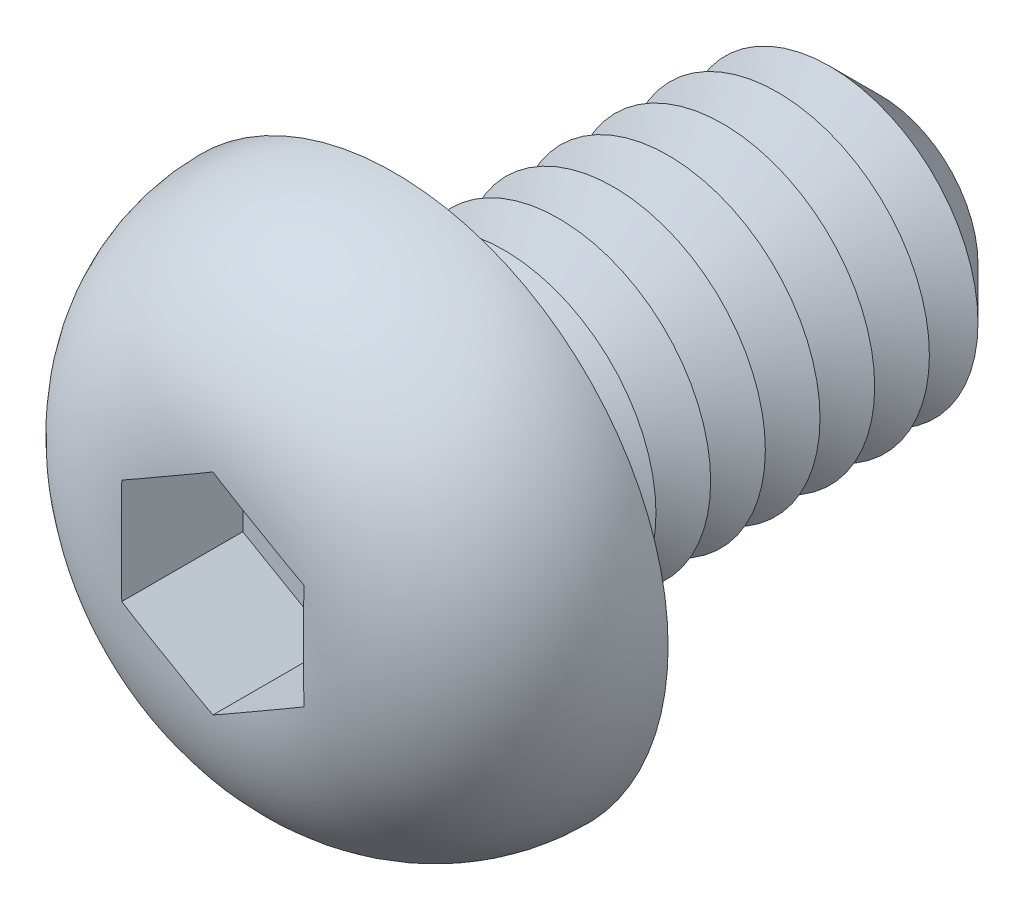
ISO-10303-21;
HEADER;
FILE_DESCRIPTION(('STEP AP214'),'2;1');
FILE_NAME('part.step','',(''),(''),'','','');
FILE_SCHEMA(('AUTOMOTIVE_DESIGN { 1 0 10303 214 1 1 1 1 }'));
ENDSEC;
DATA;
#1=APPLICATION_CONTEXT('core data for automotive mechanical design processes');
#2=APPLICATION_PROTOCOL_DEFINITION('international standard','automotive_design',2000,#1);
#3=PRODUCT_CONTEXT('',#1,'mechanical');
#4=PRODUCT('Part','Part','',(#3));
#5=PRODUCT_RELATED_PRODUCT_CATEGORY('part','',(#4));
#6=PRODUCT_DEFINITION_FORMATION('','',#4);
#7=PRODUCT_DEFINITION_CONTEXT('part definition',#1,'design');
#8=PRODUCT_DEFINITION('design','',#6,#7);
#9=PRODUCT_DEFINITION_SHAPE('','',#8);
#10=(LENGTH_UNIT() NAMED_UNIT(*) SI_UNIT(.MILLI.,.METRE.));
#11=(NAMED_UNIT(*) PLANE_ANGLE_UNIT() SI_UNIT($,.RADIAN.));
#12=(NAMED_UNIT(*) SI_UNIT($,.STERADIAN.) SOLID_ANGLE_UNIT());
#13=UNCERTAINTY_MEASURE_WITH_UNIT(LENGTH_MEASURE(1.E-05),#10,'distance_accuracy_value','');
#14=(GEOMETRIC_REPRESENTATION_CONTEXT(3) GLOBAL_UNCERTAINTY_ASSIGNED_CONTEXT((#13)) GLOBAL_UNIT_ASSIGNED_CONTEXT((#10,
#11,#12)) REPRESENTATION_CONTEXT('',''));
#15=CARTESIAN_POINT('',(0.,0.,0.));
#16=DIRECTION('',(0.,0.,1.));
#17=DIRECTION('',(1.,0.,0.));
#18=AXIS2_PLACEMENT_3D('',#15,#16,#17);
#19=CARTESIAN_POINT('',(0.,0.,-4.));
#20=DIRECTION('',(0.,0.,1.));
#21=DIRECTION('',(1.,0.,0.));
#22=AXIS2_PLACEMENT_3D('',#19,#20,#21);
#23=CYLINDRICAL_SURFACE('',#22,1.25);
#24=CARTESIAN_POINT('',(0.,0.,-0.225));
#25=DIRECTION('',(0.,0.,1.));
#26=DIRECTION('',(1.,0.,0.));
#27=AXIS2_PLACEMENT_3D('',#24,#25,#26);
#28=CIRCLE('',#27,1.25);
#29=CARTESIAN_POINT('',(1.25,0.,-0.225));
#30=VERTEX_POINT('',#29);
#31=EDGE_CURVE('E48',#30,#30,#28,.F.);
#32=ORIENTED_EDGE('',*,*,#31,.T.);
#33=EDGE_LOOP('',(#32));
#34=FACE_BOUND('',#33,.T.);
#35=CARTESIAN_POINT('',(0.,0.,-0.449999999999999));
#36=DIRECTION('',(0.,0.,1.));
#37=DIRECTION('',(1.,0.,0.));
#38=AXIS2_PLACEMENT_3D('',#35,#36,#37);
#39=CIRCLE('',#38,1.25);
#40=CARTESIAN_POINT('',(1.25,0.,-0.449999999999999));
#41=VERTEX_POINT('',#40);
#42=EDGE_CURVE('E116',#41,#41,#39,.T.);
#43=ORIENTED_EDGE('',*,*,#42,.T.);
#44=EDGE_LOOP('',(#43));
#45=FACE_BOUND('',#44,.T.);
#46=ADVANCED_FACE('F39',(#34,#45),#23,.T.);
#47=CARTESIAN_POINT('',(0.,2.25,0.));
#48=DIRECTION('',(0.,0.,1.));
#49=DIRECTION('',(1.,0.,0.));
#50=AXIS2_PLACEMENT_3D('',#47,#48,#49);
#51=PLANE('',#50);
#52=CARTESIAN_POINT('',(0.,0.,0.));
#53=DIRECTION('',(0.,0.,1.));
#54=DIRECTION('',(1.,0.,0.));
#55=AXIS2_PLACEMENT_3D('',#52,#53,#54);
#56=CIRCLE('',#55,1.475);
#57=CARTESIAN_POINT('',(1.475,0.,0.));
#58=VERTEX_POINT('',#57);
#59=EDGE_CURVE('E11',#58,#58,#56,.T.);
#60=ORIENTED_EDGE('',*,*,#59,.T.);
#61=EDGE_LOOP('',(#60));
#62=FACE_BOUND('',#61,.T.);
#63=CARTESIAN_POINT('',(0.,0.,0.));
#64=DIRECTION('',(0.,0.,1.));
#65=DIRECTION('',(1.,0.,0.));
#66=AXIS2_PLACEMENT_3D('',#63,#64,#65);
#67=CIRCLE('',#66,2.25);
#68=CARTESIAN_POINT('',(2.25,0.,0.));
#69=VERTEX_POINT('',#68);
#70=EDGE_CURVE('E140',#69,#69,#67,.T.);
#71=ORIENTED_EDGE('',*,*,#70,.F.);
#72=EDGE_LOOP('',(#71));
#73=FACE_BOUND('',#72,.T.);
#74=ADVANCED_FACE('F249',(#62,#73),#51,.F.);
#75=CARTESIAN_POINT('',(0.,0.,0.));
#76=DIRECTION('',(0.,0.,1.));
#77=DIRECTION('',(1.,0.,0.));
#78=AXIS2_PLACEMENT_3D('',#75,#76,#77);
#79=DEGENERATE_TOROIDAL_SURFACE('',#78,0.75,1.5,.T.);
#80=CARTESIAN_POINT('',(-0.00020000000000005,0.866140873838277,1.49549700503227));
#81=CARTESIAN_POINT('',(0.0310550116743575,0.848095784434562,1.4968946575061));
#82=CARTESIAN_POINT('',(0.0623199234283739,0.83004497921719,1.49783965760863));
#83=CARTESIAN_POINT('',(0.124855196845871,0.793940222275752,1.49913317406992));
#84=CARTESIAN_POINT('',(0.156125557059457,0.775886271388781,1.49948177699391));
#85=CARTESIAN_POINT('',(0.218662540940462,0.739780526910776,1.49989152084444));
#86=CARTESIAN_POINT('',(0.249929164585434,0.7217287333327,1.49995269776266));
#87=CARTESIAN_POINT('',(0.312463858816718,0.685624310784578,1.50000693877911));
#88=CARTESIAN_POINT('',(0.343731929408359,0.667571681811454,1.5));
#89=CARTESIAN_POINT('',(0.40626807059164,0.631466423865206,1.5));
#90=CARTESIAN_POINT('',(0.437536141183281,0.613413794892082,1.50000693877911));
#91=CARTESIAN_POINT('',(0.500070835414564,0.577309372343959,1.49995269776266));
#92=CARTESIAN_POINT('',(0.531337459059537,0.559257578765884,1.49989152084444));
#93=CARTESIAN_POINT('',(0.593874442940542,0.523151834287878,1.49948177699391));
#94=CARTESIAN_POINT('',(0.625144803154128,0.505097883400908,1.49913317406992));
#95=CARTESIAN_POINT('',(0.687680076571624,0.468993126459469,1.49783965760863));
#96=CARTESIAN_POINT('',(0.718944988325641,0.450942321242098,1.49689465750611));
#97=CARTESIAN_POINT('',(0.750199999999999,0.432897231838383,1.4954970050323));
#98=B_SPLINE_CURVE_WITH_KNOTS('',3,(#80,#81,#82,#83,#84,#85,#86,#87,#88,#89,#90,#91,#92,#93,#94,
#95,#96,#97),.UNSPECIFIED.,.F.,.F.,(4,2,2,2,2,2,2,2,4),(0.,0.108340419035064,0.216665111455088,
0.324976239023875,0.433291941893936,0.541607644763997,0.649918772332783,0.758243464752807,
0.866583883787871),.UNSPECIFIED.);
#99=CARTESIAN_POINT('',(0.,0.866025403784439,1.49550596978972));
#100=VERTEX_POINT('',#99);
#101=CARTESIAN_POINT('',(0.75,0.43301270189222,1.49550596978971));
#102=VERTEX_POINT('',#101);
#103=EDGE_CURVE('E62',#100,#102,#98,.T.);
#104=ORIENTED_EDGE('',*,*,#103,.T.);
#105=CARTESIAN_POINT('',(0.75,0.,1.5));
#106=CARTESIAN_POINT('',(0.75,-0.0627080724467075,1.50000006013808));
#107=CARTESIAN_POINT('',(0.75,-0.125416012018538,1.50006294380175));
#108=CARTESIAN_POINT('',(0.75,-0.250852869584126,1.49957707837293));
#109=CARTESIAN_POINT('',(0.75,-0.313581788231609,1.49902814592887));
#110=CARTESIAN_POINT('',(0.75,-0.438802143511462,1.49567950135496));
#111=CARTESIAN_POINT('',(0.75,-0.501293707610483,1.49288685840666));
#112=CARTESIAN_POINT('',(0.75,-0.625982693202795,1.48341085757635));
#113=CARTESIAN_POINT('',(0.75,-0.688180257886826,1.47672964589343));
#114=CARTESIAN_POINT('',(0.75,-0.798866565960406,1.46016399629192));
#115=CARTESIAN_POINT('',(0.75,-0.847497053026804,1.45124406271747));
#116=CARTESIAN_POINT('',(0.75,-0.943962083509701,1.42976864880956));
#117=CARTESIAN_POINT('',(0.75,-0.991796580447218,1.41721295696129));
#118=CARTESIAN_POINT('',(0.75,-1.08630476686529,1.38817887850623));
#119=CARTESIAN_POINT('',(0.75,-1.13297775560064,1.37169818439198));
#120=CARTESIAN_POINT('',(0.75,-1.22469462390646,1.33469293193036));
#121=CARTESIAN_POINT('',(0.75,-1.26973805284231,1.31416726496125));
#122=CARTESIAN_POINT('',(0.75,-1.40247100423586,1.24607127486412));
#123=CARTESIAN_POINT('',(0.750000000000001,-1.48705462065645,1.19219273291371));
#124=CARTESIAN_POINT('',(0.750000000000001,-1.64393724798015,1.06881737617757));
#125=CARTESIAN_POINT('',(0.750000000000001,-1.71623917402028,0.99932427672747));
#126=CARTESIAN_POINT('',(0.750000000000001,-1.83613547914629,0.857842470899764));
#127=CARTESIAN_POINT('',(0.750000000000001,-1.88577468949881,0.787579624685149));
#128=CARTESIAN_POINT('',(0.750000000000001,-1.97175648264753,0.639365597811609));
#129=CARTESIAN_POINT('',(0.750000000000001,-2.00810707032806,0.56141908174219));
#130=CARTESIAN_POINT('',(0.750000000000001,-2.06466924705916,0.404589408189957));
#131=CARTESIAN_POINT('',(0.750000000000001,-2.08563938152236,0.325978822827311));
#132=CARTESIAN_POINT('',(0.750000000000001,-2.11383941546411,0.166329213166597));
#133=CARTESIAN_POINT('',(0.750000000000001,-2.12107071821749,0.0852904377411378));
#134=CARTESIAN_POINT('',(0.750000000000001,-2.12155325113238,-0.0754758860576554));
#135=CARTESIAN_POINT('',(0.750000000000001,-2.11503465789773,-0.155202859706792));
#136=CARTESIAN_POINT('',(0.750000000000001,-2.08869127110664,-0.312426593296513));
#137=CARTESIAN_POINT('',(0.750000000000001,-2.06886647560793,-0.389923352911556));
#138=CARTESIAN_POINT('',(0.750000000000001,-2.01655236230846,-0.540457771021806));
#139=CARTESIAN_POINT('',(0.750000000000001,-1.98407088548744,-0.613498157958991));
#140=CARTESIAN_POINT('',(0.750000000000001,-1.9074704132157,-0.753167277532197));
#141=CARTESIAN_POINT('',(0.750000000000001,-1.86335369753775,-0.81979726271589));
#142=CARTESIAN_POINT('',(0.750000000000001,-1.76418094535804,-0.945786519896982));
#143=CARTESIAN_POINT('',(0.750000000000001,-1.70898715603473,-1.00503724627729));
#144=CARTESIAN_POINT('',(0.750000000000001,-1.58971135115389,-1.11387170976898));
#145=CARTESIAN_POINT('',(0.75,-1.52562045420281,-1.16344566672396));
#146=CARTESIAN_POINT('',(0.75,-1.38780810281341,-1.25370948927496));
#147=CARTESIAN_POINT('',(0.75,-1.31380696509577,-1.29397311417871));
#148=CARTESIAN_POINT('',(0.75,-1.19908931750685,-1.34544517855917));
#149=CARTESIAN_POINT('',(0.75,-1.16029271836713,-1.36109820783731));
#150=CARTESIAN_POINT('',(0.75,-1.08166825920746,-1.38954640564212));
#151=CARTESIAN_POINT('',(0.75,-1.04184052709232,-1.40234192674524));
#152=CARTESIAN_POINT('',(0.75,-0.922724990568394,-1.43614112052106));
#153=CARTESIAN_POINT('',(0.75,-0.842305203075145,-1.45321262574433));
#154=CARTESIAN_POINT('',(0.75,-0.680054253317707,-1.47833811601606));
#155=CARTESIAN_POINT('',(0.75,-0.598220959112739,-1.48637700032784));
#156=CARTESIAN_POINT('',(0.75,-0.432952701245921,-1.4964806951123));
#157=CARTESIAN_POINT('',(0.75,-0.349513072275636,-1.49844778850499));
#158=CARTESIAN_POINT('',(0.75,-0.224384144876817,-1.49972680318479));
#159=CARTESIAN_POINT('',(0.75,-0.182687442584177,-1.49987466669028));
#160=CARTESIAN_POINT('',(0.75,-0.0992944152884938,-1.50001027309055));
#161=CARTESIAN_POINT('',(0.75,-0.0575980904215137,-1.49999802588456));
#162=CARTESIAN_POINT('',(0.75,0.0343362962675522,-1.50000235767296));
#163=CARTESIAN_POINT('',(0.75,0.0845742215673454,-1.50002535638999));
#164=CARTESIAN_POINT('',(0.75,0.185055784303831,-1.49987831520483));
#165=CARTESIAN_POINT('',(0.75,0.235299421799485,-1.49970825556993));
#166=CARTESIAN_POINT('',(0.75,0.335816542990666,-1.49845206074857));
#167=CARTESIAN_POINT('',(0.75,0.386090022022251,-1.49736526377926));
#168=CARTESIAN_POINT('',(0.75,0.486569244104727,-1.49338674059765));
#169=CARTESIAN_POINT('',(0.75,0.536774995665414,-1.49049526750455));
#170=CARTESIAN_POINT('',(0.75,0.636034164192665,-1.4821682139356));
#171=CARTESIAN_POINT('',(0.75,0.685091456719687,-1.47678164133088));
#172=CARTESIAN_POINT('',(0.75,0.78275573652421,-1.46286947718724));
#173=CARTESIAN_POINT('',(0.75,0.831362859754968,-1.45434486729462));
#174=CARTESIAN_POINT('',(0.75,0.92771552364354,-1.43373454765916));
#175=CARTESIAN_POINT('',(0.75,0.975462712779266,-1.42165664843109));
#176=CARTESIAN_POINT('',(0.75,1.06980144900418,-1.39365234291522));
#177=CARTESIAN_POINT('',(0.75,1.11639353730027,-1.37772777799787));
#178=CARTESIAN_POINT('',(0.75,1.20164461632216,-1.3443737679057));
#179=CARTESIAN_POINT('',(0.75,1.24050600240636,-1.32746129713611));
#180=CARTESIAN_POINT('',(0.75,1.31679530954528,-1.29064565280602));
#181=CARTESIAN_POINT('',(0.75,1.35422305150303,-1.27074210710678));
#182=CARTESIAN_POINT('',(0.75,1.42755003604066,-1.22785786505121));
#183=CARTESIAN_POINT('',(0.75,1.46343995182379,-1.20486115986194));
#184=CARTESIAN_POINT('',(0.75,1.53317270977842,-1.15597138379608));
#185=CARTESIAN_POINT('',(0.75,1.56701570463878,-1.1300785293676));
#186=CARTESIAN_POINT('',(0.75,1.66513078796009,-1.04815589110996));
#187=CARTESIAN_POINT('',(0.75,1.72596640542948,-0.987895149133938));
#188=CARTESIAN_POINT('',(0.75,1.83611610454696,-0.857815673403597));
#189=CARTESIAN_POINT('',(0.75,1.88544739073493,-0.78801146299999));
#190=CARTESIAN_POINT('',(0.75,1.96970141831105,-0.64303465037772));
#191=CARTESIAN_POINT('',(0.75,2.00501928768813,-0.568092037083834));
#192=CARTESIAN_POINT('',(0.75,2.06216371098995,-0.413201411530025));
#193=CARTESIAN_POINT('',(0.75,2.08398748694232,-0.333252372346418));
#194=CARTESIAN_POINT('',(0.75,2.11297506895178,-0.173098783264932));
#195=CARTESIAN_POINT('',(0.75,2.12053880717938,-0.0929664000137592));
#196=CARTESIAN_POINT('',(0.75,2.1219864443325,0.0674127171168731));
#197=CARTESIAN_POINT('',(0.75,2.1158724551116,0.147659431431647));
#198=CARTESIAN_POINT('',(0.75,2.09026719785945,0.305329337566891));
#199=CARTESIAN_POINT('',(0.75,2.07088260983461,0.382769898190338));
#200=CARTESIAN_POINT('',(0.75,2.01945905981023,0.53332273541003));
#201=CARTESIAN_POINT('',(0.75,1.98742024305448,0.606435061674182));
#202=CARTESIAN_POINT('',(0.75,1.91146692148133,0.746751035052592));
#203=CARTESIAN_POINT('',(0.75,1.86748433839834,0.813917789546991));
#204=CARTESIAN_POINT('',(0.75,1.76910058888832,0.940116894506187));
#205=CARTESIAN_POINT('',(0.75,1.71469868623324,0.999148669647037));
#206=CARTESIAN_POINT('',(0.75,1.59577189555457,1.10896258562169));
#207=CARTESIAN_POINT('',(0.75,1.53104176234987,1.15952203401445));
#208=CARTESIAN_POINT('',(0.75,1.3944150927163,1.24972990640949));
#209=CARTESIAN_POINT('',(0.75,1.32251811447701,1.28937765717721));
#210=CARTESIAN_POINT('',(0.75,1.16914901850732,1.35951213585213));
#211=CARTESIAN_POINT('',(0.75,1.08736098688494,1.38930295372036));
#212=CARTESIAN_POINT('',(0.75,0.920496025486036,1.43689243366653));
#213=CARTESIAN_POINT('',(0.75,0.835420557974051,1.45469636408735));
#214=CARTESIAN_POINT('',(0.75,0.687870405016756,1.476773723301));
#215=CARTESIAN_POINT('',(0.75,0.625720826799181,1.48343749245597));
#216=CARTESIAN_POINT('',(0.75,0.501109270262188,1.49289411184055));
#217=CARTESIAN_POINT('',(0.75,0.438647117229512,1.49568447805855));
#218=CARTESIAN_POINT('',(0.75,0.313477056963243,1.49903009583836));
#219=CARTESIAN_POINT('',(0.75,0.250769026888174,1.49957783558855));
#220=CARTESIAN_POINT('',(0.75,0.125373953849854,1.50006266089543));
#221=CARTESIAN_POINT('',(0.75,0.0626869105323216,1.49999993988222));
#222=CARTESIAN_POINT('',(0.75,0.,1.5));
#223=B_SPLINE_CURVE_WITH_KNOTS('',3,(#105,#106,#107,#108,#109,#110,#111,#112,#113,#114,#115,
#116,#117,#118,#119,#120,#121,#122,#123,#124,#125,#126,#127,#128,#129,#130,#131,#132,#133,#134,
#135,#136,#137,#138,#139,#140,#141,#142,#143,#144,#145,#146,#147,#148,#149,#150,#151,#152,#153,
#154,#155,#156,#157,#158,#159,#160,#161,#162,#163,#164,#165,#166,#167,#168,#169,#170,#171,#172,
#173,#174,#175,#176,#177,#178,#179,#180,#181,#182,#183,#184,#185,#186,#187,#188,#189,#190,#191,
#192,#193,#194,#195,#196,#197,#198,#199,#200,#201,#202,#203,#204,#205,#206,#207,#208,#209,#210,
#211,#212,#213,#214,#215,#216,#217,#218,#219,#220,#221,#222),.UNSPECIFIED.,.T.,.F.,(4,2,2,2,2,2,
2,2,2,2,2,2,2,2,2,2,2,2,2,2,2,2,2,2,2,2,2,2,2,2,2,2,2,2,2,2,2,2,2,2,2,2,2,2,2,2,2,2,2,2,2,2,2,2,
2,2,2,2,4),(0.,0.188125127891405,0.376306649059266,0.563897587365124,0.75138508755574,
0.899588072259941,1.04779968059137,1.19609863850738,1.34443829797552,1.64330264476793,
1.94209595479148,2.19886247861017,2.45547407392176,2.69837467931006,2.94125047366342,
3.18009276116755,3.418935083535,3.65762967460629,3.89627753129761,4.13810096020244,
4.38016754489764,4.63175737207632,4.75717060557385,4.88256835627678,5.12849835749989,
5.37483889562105,5.62512380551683,5.75021912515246,5.87530671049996,6.02602122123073,
6.17675113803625,6.32758995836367,6.47840762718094,6.62638101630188,6.77430815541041,
6.92191253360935,7.06944639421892,7.19647012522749,7.32350967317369,7.4512340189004,
7.57894882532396,7.83445576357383,8.08957810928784,8.33688433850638,8.58424146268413,
8.82455168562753,9.06482480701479,9.30318875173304,9.54154996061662,9.781299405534,
10.0210657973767,10.266384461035,10.511718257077,10.7718340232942,11.0318353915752,
11.219209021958,11.4067027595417,11.5948240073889,11.7828856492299),.UNSPECIFIED.);
#224=CARTESIAN_POINT('',(0.75,-0.43301270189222,1.49550596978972));
#225=VERTEX_POINT('',#224);
#226=EDGE_CURVE('E215',#102,#225,#223,.T.);
#227=ORIENTED_EDGE('',*,*,#226,.T.);
#228=CARTESIAN_POINT('',(0.7502,-0.432897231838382,1.49549700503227));
#229=CARTESIAN_POINT('',(0.718944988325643,-0.450942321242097,1.4968946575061));
#230=CARTESIAN_POINT('',(0.687680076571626,-0.468993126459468,1.49783965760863));
#231=CARTESIAN_POINT('',(0.625144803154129,-0.505097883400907,1.49913317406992));
#232=CARTESIAN_POINT('',(0.593874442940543,-0.523151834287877,1.49948177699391));
#233=CARTESIAN_POINT('',(0.531337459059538,-0.559257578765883,1.49989152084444));
#234=CARTESIAN_POINT('',(0.500070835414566,-0.577309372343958,1.49995269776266));
#235=CARTESIAN_POINT('',(0.437536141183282,-0.613413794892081,1.50000693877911));
#236=CARTESIAN_POINT('',(0.406268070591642,-0.631466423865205,1.5));
#237=CARTESIAN_POINT('',(0.34373192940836,-0.667571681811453,1.5));
#238=CARTESIAN_POINT('',(0.312463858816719,-0.685624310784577,1.50000693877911));
#239=CARTESIAN_POINT('',(0.249929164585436,-0.721728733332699,1.49995269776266));
#240=CARTESIAN_POINT('',(0.218662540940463,-0.739780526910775,1.49989152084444));
#241=CARTESIAN_POINT('',(0.156125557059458,-0.77588627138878,1.49948177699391));
#242=CARTESIAN_POINT('',(0.124855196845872,-0.793940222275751,1.49913317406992));
#243=CARTESIAN_POINT('',(0.0623199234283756,-0.830044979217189,1.49783965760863));
#244=CARTESIAN_POINT('',(0.0310550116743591,-0.848095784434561,1.49689465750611));
#245=CARTESIAN_POINT('',(-0.000199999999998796,-0.866140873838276,1.4954970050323));
#246=B_SPLINE_CURVE_WITH_KNOTS('',3,(#228,#229,#230,#231,#232,#233,#234,#235,#236,#237,#238,
#239,#240,#241,#242,#243,#244,#245),.UNSPECIFIED.,.F.,.F.,(4,2,2,2,2,2,2,2,4),(0.,
0.108340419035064,0.216665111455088,0.324976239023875,0.433291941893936,0.541607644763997,
0.649918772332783,0.758243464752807,0.866583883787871),.UNSPECIFIED.);
#247=CARTESIAN_POINT('',(0.,-0.866025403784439,1.49550596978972));
#248=VERTEX_POINT('',#247);
#249=EDGE_CURVE('E195',#225,#248,#246,.T.);
#250=ORIENTED_EDGE('',*,*,#249,.T.);
#251=CARTESIAN_POINT('',(0.000200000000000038,-0.866140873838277,1.49549700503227));
#252=CARTESIAN_POINT('',(-0.0310550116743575,-0.848095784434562,1.4968946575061));
#253=CARTESIAN_POINT('',(-0.0623199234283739,-0.83004497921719,1.49783965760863));
#254=CARTESIAN_POINT('',(-0.124855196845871,-0.793940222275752,1.49913317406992));
#255=CARTESIAN_POINT('',(-0.156125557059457,-0.775886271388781,1.49948177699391));
#256=CARTESIAN_POINT('',(-0.218662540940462,-0.739780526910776,1.49989152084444));
#257=CARTESIAN_POINT('',(-0.249929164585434,-0.7217287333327,1.49995269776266));
#258=CARTESIAN_POINT('',(-0.312463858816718,-0.685624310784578,1.50000693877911));
#259=CARTESIAN_POINT('',(-0.343731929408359,-0.667571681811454,1.5));
#260=CARTESIAN_POINT('',(-0.40626807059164,-0.631466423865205,1.5));
#261=CARTESIAN_POINT('',(-0.437536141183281,-0.613413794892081,1.50000693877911));
#262=CARTESIAN_POINT('',(-0.500070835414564,-0.577309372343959,1.49995269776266));
#263=CARTESIAN_POINT('',(-0.531337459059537,-0.559257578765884,1.49989152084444));
#264=CARTESIAN_POINT('',(-0.593874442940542,-0.523151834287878,1.49948177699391));
#265=CARTESIAN_POINT('',(-0.625144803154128,-0.505097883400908,1.49913317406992));
#266=CARTESIAN_POINT('',(-0.687680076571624,-0.468993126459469,1.49783965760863));
#267=CARTESIAN_POINT('',(-0.718944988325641,-0.450942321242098,1.49689465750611));
#268=CARTESIAN_POINT('',(-0.750199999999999,-0.432897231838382,1.4954970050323));
#269=B_SPLINE_CURVE_WITH_KNOTS('',3,(#251,#252,#253,#254,#255,#256,#257,#258,#259,#260,#261,
#262,#263,#264,#265,#266,#267,#268),.UNSPECIFIED.,.F.,.F.,(4,2,2,2,2,2,2,2,4),(0.,
0.108340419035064,0.216665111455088,0.324976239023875,0.433291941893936,0.541607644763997,
0.649918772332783,0.758243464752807,0.866583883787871),.UNSPECIFIED.);
#270=CARTESIAN_POINT('',(-0.75,-0.433012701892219,1.49550596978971));
#271=VERTEX_POINT('',#270);
#272=EDGE_CURVE('E188',#248,#271,#269,.T.);
#273=ORIENTED_EDGE('',*,*,#272,.T.);
#274=CARTESIAN_POINT('',(-0.75,0.,1.5));
#275=CARTESIAN_POINT('',(-0.75,0.0627080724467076,1.50000006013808));
#276=CARTESIAN_POINT('',(-0.75,0.125416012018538,1.50006294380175));
#277=CARTESIAN_POINT('',(-0.75,0.250852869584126,1.49957707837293));
#278=CARTESIAN_POINT('',(-0.75,0.313581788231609,1.49902814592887));
#279=CARTESIAN_POINT('',(-0.75,0.438802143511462,1.49567950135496));
#280=CARTESIAN_POINT('',(-0.75,0.501293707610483,1.49288685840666));
#281=CARTESIAN_POINT('',(-0.75,0.625982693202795,1.48341085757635));
#282=CARTESIAN_POINT('',(-0.75,0.688180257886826,1.47672964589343));
#283=CARTESIAN_POINT('',(-0.75,0.798866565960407,1.46016399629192));
#284=CARTESIAN_POINT('',(-0.75,0.847497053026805,1.45124406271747));
#285=CARTESIAN_POINT('',(-0.75,0.943962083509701,1.42976864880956));
#286=CARTESIAN_POINT('',(-0.75,0.991796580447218,1.41721295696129));
#287=CARTESIAN_POINT('',(-0.75,1.08630476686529,1.38817887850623));
#288=CARTESIAN_POINT('',(-0.75,1.13297775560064,1.37169818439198));
#289=CARTESIAN_POINT('',(-0.75,1.22469462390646,1.33469293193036));
#290=CARTESIAN_POINT('',(-0.75,1.26973805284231,1.31416726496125));
#291=CARTESIAN_POINT('',(-0.75,1.40247100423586,1.24607127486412));
#292=CARTESIAN_POINT('',(-0.75,1.48705462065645,1.19219273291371));
#293=CARTESIAN_POINT('',(-0.75,1.64393724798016,1.06881737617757));
#294=CARTESIAN_POINT('',(-0.75,1.71623917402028,0.99932427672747));
#295=CARTESIAN_POINT('',(-0.75,1.83613547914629,0.857842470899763));
#296=CARTESIAN_POINT('',(-0.75,1.88577468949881,0.787579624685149));
#297=CARTESIAN_POINT('',(-0.75,1.97175648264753,0.639365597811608));
#298=CARTESIAN_POINT('',(-0.75,2.00810707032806,0.561419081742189));
#299=CARTESIAN_POINT('',(-0.75,2.06466924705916,0.404589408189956));
#300=CARTESIAN_POINT('',(-0.75,2.08563938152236,0.325978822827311));
#301=CARTESIAN_POINT('',(-0.75,2.11383941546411,0.166329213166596));
#302=CARTESIAN_POINT('',(-0.75,2.12107071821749,0.0852904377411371));
#303=CARTESIAN_POINT('',(-0.75,2.12155325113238,-0.0754758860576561));
#304=CARTESIAN_POINT('',(-0.75,2.11503465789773,-0.155202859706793));
#305=CARTESIAN_POINT('',(-0.75,2.08869127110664,-0.312426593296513));
#306=CARTESIAN_POINT('',(-0.75,2.06886647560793,-0.389923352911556));
#307=CARTESIAN_POINT('',(-0.75,2.01655236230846,-0.540457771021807));
#308=CARTESIAN_POINT('',(-0.75,1.98407088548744,-0.613498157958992));
#309=CARTESIAN_POINT('',(-0.75,1.9074704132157,-0.753167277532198));
#310=CARTESIAN_POINT('',(-0.75,1.86335369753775,-0.81979726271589));
#311=CARTESIAN_POINT('',(-0.75,1.76418094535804,-0.945786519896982));
#312=CARTESIAN_POINT('',(-0.75,1.70898715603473,-1.00503724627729));
#313=CARTESIAN_POINT('',(-0.75,1.58971135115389,-1.11387170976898));
#314=CARTESIAN_POINT('',(-0.75,1.52562045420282,-1.16344566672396));
#315=CARTESIAN_POINT('',(-0.75,1.38780810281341,-1.25370948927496));
#316=CARTESIAN_POINT('',(-0.75,1.31380696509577,-1.29397311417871));
#317=CARTESIAN_POINT('',(-0.75,1.19908931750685,-1.34544517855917));
#318=CARTESIAN_POINT('',(-0.75,1.16029271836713,-1.36109820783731));
#319=CARTESIAN_POINT('',(-0.75,1.08166825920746,-1.38954640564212));
#320=CARTESIAN_POINT('',(-0.75,1.04184052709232,-1.40234192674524));
#321=CARTESIAN_POINT('',(-0.75,0.922724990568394,-1.43614112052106));
#322=CARTESIAN_POINT('',(-0.75,0.842305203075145,-1.45321262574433));
#323=CARTESIAN_POINT('',(-0.75,0.680054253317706,-1.47833811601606));
#324=CARTESIAN_POINT('',(-0.75,0.598220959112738,-1.48637700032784));
#325=CARTESIAN_POINT('',(-0.75,0.43295270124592,-1.4964806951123));
#326=CARTESIAN_POINT('',(-0.75,0.349513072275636,-1.49844778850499));
#327=CARTESIAN_POINT('',(-0.75,0.224384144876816,-1.49972680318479));
#328=CARTESIAN_POINT('',(-0.75,0.182687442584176,-1.49987466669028));
#329=CARTESIAN_POINT('',(-0.75,0.0992944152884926,-1.50001027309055));
#330=CARTESIAN_POINT('',(-0.75,0.0575980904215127,-1.49999802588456));
#331=CARTESIAN_POINT('',(-0.75,-0.0343362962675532,-1.50000235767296));
#332=CARTESIAN_POINT('',(-0.75,-0.0845742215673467,-1.50002535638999));
#333=CARTESIAN_POINT('',(-0.75,-0.185055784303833,-1.49987831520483));
#334=CARTESIAN_POINT('',(-0.75,-0.235299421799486,-1.49970825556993));
#335=CARTESIAN_POINT('',(-0.75,-0.335816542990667,-1.49845206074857));
#336=CARTESIAN_POINT('',(-0.75,-0.386090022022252,-1.49736526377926));
#337=CARTESIAN_POINT('',(-0.75,-0.486569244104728,-1.49338674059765));
#338=CARTESIAN_POINT('',(-0.75,-0.536774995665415,-1.49049526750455));
#339=CARTESIAN_POINT('',(-0.75,-0.636034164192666,-1.4821682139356));
#340=CARTESIAN_POINT('',(-0.75,-0.685091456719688,-1.47678164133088));
#341=CARTESIAN_POINT('',(-0.75,-0.782755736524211,-1.46286947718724));
#342=CARTESIAN_POINT('',(-0.75,-0.831362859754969,-1.45434486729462));
#343=CARTESIAN_POINT('',(-0.75,-0.927715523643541,-1.43373454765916));
#344=CARTESIAN_POINT('',(-0.75,-0.975462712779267,-1.42165664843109));
#345=CARTESIAN_POINT('',(-0.75,-1.06980144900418,-1.39365234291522));
#346=CARTESIAN_POINT('',(-0.75,-1.11639353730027,-1.37772777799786));
#347=CARTESIAN_POINT('',(-0.75,-1.20164461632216,-1.3443737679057));
#348=CARTESIAN_POINT('',(-0.75,-1.24050600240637,-1.32746129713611));
#349=CARTESIAN_POINT('',(-0.75,-1.31679530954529,-1.29064565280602));
#350=CARTESIAN_POINT('',(-0.75,-1.35422305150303,-1.27074210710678));
#351=CARTESIAN_POINT('',(-0.75,-1.42755003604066,-1.22785786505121));
#352=CARTESIAN_POINT('',(-0.75,-1.46343995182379,-1.20486115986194));
#353=CARTESIAN_POINT('',(-0.75,-1.53317270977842,-1.15597138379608));
#354=CARTESIAN_POINT('',(-0.75,-1.56701570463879,-1.1300785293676));
#355=CARTESIAN_POINT('',(-0.75,-1.66513078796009,-1.04815589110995));
#356=CARTESIAN_POINT('',(-0.75,-1.72596640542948,-0.987895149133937));
#357=CARTESIAN_POINT('',(-0.75,-1.83611610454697,-0.857815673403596));
#358=CARTESIAN_POINT('',(-0.75,-1.88544739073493,-0.788011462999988));
#359=CARTESIAN_POINT('',(-0.75,-1.96970141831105,-0.643034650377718));
#360=CARTESIAN_POINT('',(-0.75,-2.00501928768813,-0.568092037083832));
#361=CARTESIAN_POINT('',(-0.75,-2.06216371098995,-0.413201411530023));
#362=CARTESIAN_POINT('',(-0.75,-2.08398748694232,-0.333252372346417));
#363=CARTESIAN_POINT('',(-0.75,-2.11297506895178,-0.173098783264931));
#364=CARTESIAN_POINT('',(-0.75,-2.12053880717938,-0.0929664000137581));
#365=CARTESIAN_POINT('',(-0.75,-2.1219864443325,0.0674127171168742));
#366=CARTESIAN_POINT('',(-0.75,-2.1158724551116,0.147659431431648));
#367=CARTESIAN_POINT('',(-0.75,-2.09026719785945,0.305329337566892));
#368=CARTESIAN_POINT('',(-0.75,-2.07088260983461,0.382769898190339));
#369=CARTESIAN_POINT('',(-0.75,-2.01945905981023,0.533322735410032));
#370=CARTESIAN_POINT('',(-0.75,-1.98742024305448,0.606435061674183));
#371=CARTESIAN_POINT('',(-0.75,-1.91146692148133,0.746751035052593));
#372=CARTESIAN_POINT('',(-0.75,-1.86748433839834,0.813917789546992));
#373=CARTESIAN_POINT('',(-0.75,-1.76910058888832,0.940116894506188));
#374=CARTESIAN_POINT('',(-0.75,-1.71469868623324,0.999148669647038));
#375=CARTESIAN_POINT('',(-0.75,-1.59577189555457,1.10896258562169));
#376=CARTESIAN_POINT('',(-0.75,-1.53104176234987,1.15952203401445));
#377=CARTESIAN_POINT('',(-0.75,-1.3944150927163,1.24972990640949));
#378=CARTESIAN_POINT('',(-0.75,-1.32251811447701,1.28937765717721));
#379=CARTESIAN_POINT('',(-0.75,-1.16914901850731,1.35951213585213));
#380=CARTESIAN_POINT('',(-0.75,-1.08736098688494,1.38930295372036));
#381=CARTESIAN_POINT('',(-0.75,-0.920496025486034,1.43689243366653));
#382=CARTESIAN_POINT('',(-0.75,-0.83542055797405,1.45469636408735));
#383=CARTESIAN_POINT('',(-0.75,-0.687870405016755,1.476773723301));
#384=CARTESIAN_POINT('',(-0.75,-0.625720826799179,1.48343749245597));
#385=CARTESIAN_POINT('',(-0.75,-0.501109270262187,1.49289411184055));
#386=CARTESIAN_POINT('',(-0.75,-0.438647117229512,1.49568447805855));
#387=CARTESIAN_POINT('',(-0.75,-0.313477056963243,1.49903009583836));
#388=CARTESIAN_POINT('',(-0.75,-0.250769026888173,1.49957783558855));
#389=CARTESIAN_POINT('',(-0.75,-0.125373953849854,1.50006266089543));
#390=CARTESIAN_POINT('',(-0.75,-0.0626869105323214,1.49999993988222));
#391=CARTESIAN_POINT('',(-0.75,0.,1.5));
#392=B_SPLINE_CURVE_WITH_KNOTS('',3,(#274,#275,#276,#277,#278,#279,#280,#281,#282,#283,#284,
#285,#286,#287,#288,#289,#290,#291,#292,#293,#294,#295,#296,#297,#298,#299,#300,#301,#302,#303,
#304,#305,#306,#307,#308,#309,#310,#311,#312,#313,#314,#315,#316,#317,#318,#319,#320,#321,#322,
#323,#324,#325,#326,#327,#328,#329,#330,#331,#332,#333,#334,#335,#336,#337,#338,#339,#340,#341,
#342,#343,#344,#345,#346,#347,#348,#349,#350,#351,#352,#353,#354,#355,#356,#357,#358,#359,#360,
#361,#362,#363,#364,#365,#366,#367,#368,#369,#370,#371,#372,#373,#374,#375,#376,#377,#378,#379,
#380,#381,#382,#383,#384,#385,#386,#387,#388,#389,#390,#391),.UNSPECIFIED.,.T.,.F.,(4,2,2,2,2,2,
2,2,2,2,2,2,2,2,2,2,2,2,2,2,2,2,2,2,2,2,2,2,2,2,2,2,2,2,2,2,2,2,2,2,2,2,2,2,2,2,2,2,2,2,2,2,2,2,
2,2,2,2,4),(0.,0.188125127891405,0.376306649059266,0.563897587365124,0.75138508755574,
0.899588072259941,1.04779968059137,1.19609863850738,1.34443829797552,1.64330264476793,
1.94209595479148,2.19886247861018,2.45547407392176,2.69837467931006,2.94125047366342,
3.18009276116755,3.418935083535,3.65762967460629,3.89627753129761,4.13810096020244,
4.38016754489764,4.63175737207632,4.75717060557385,4.88256835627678,5.12849835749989,
5.37483889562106,5.62512380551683,5.75021912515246,5.87530671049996,6.02602122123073,
6.17675113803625,6.32758995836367,6.47840762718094,6.62638101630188,6.77430815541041,
6.92191253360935,7.06944639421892,7.19647012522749,7.32350967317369,7.4512340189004,
7.57894882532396,7.83445576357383,8.08957810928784,8.33688433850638,8.58424146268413,
8.82455168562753,9.06482480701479,9.30318875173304,9.54154996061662,9.781299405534,
10.0210657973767,10.266384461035,10.511718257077,10.7718340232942,11.0318353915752,
11.219209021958,11.4067027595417,11.5948240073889,11.7828856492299),.UNSPECIFIED.);
#393=CARTESIAN_POINT('',(-0.75,0.43301270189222,1.49550596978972));
#394=VERTEX_POINT('',#393);
#395=EDGE_CURVE('E166',#271,#394,#392,.T.);
#396=ORIENTED_EDGE('',*,*,#395,.T.);
#397=CARTESIAN_POINT('',(-0.7502,0.432897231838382,1.49549700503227));
#398=CARTESIAN_POINT('',(-0.718944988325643,0.450942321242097,1.4968946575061));
#399=CARTESIAN_POINT('',(-0.687680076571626,0.468993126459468,1.49783965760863));
#400=CARTESIAN_POINT('',(-0.62514480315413,0.505097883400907,1.49913317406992));
#401=CARTESIAN_POINT('',(-0.593874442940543,0.523151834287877,1.49948177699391));
#402=CARTESIAN_POINT('',(-0.531337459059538,0.559257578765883,1.49989152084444));
#403=CARTESIAN_POINT('',(-0.500070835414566,0.577309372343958,1.49995269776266));
#404=CARTESIAN_POINT('',(-0.437536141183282,0.613413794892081,1.50000693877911));
#405=CARTESIAN_POINT('',(-0.406268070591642,0.631466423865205,1.5));
#406=CARTESIAN_POINT('',(-0.34373192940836,0.667571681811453,1.5));
#407=CARTESIAN_POINT('',(-0.312463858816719,0.685624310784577,1.50000693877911));
#408=CARTESIAN_POINT('',(-0.249929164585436,0.721728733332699,1.49995269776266));
#409=CARTESIAN_POINT('',(-0.218662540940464,0.739780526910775,1.49989152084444));
#410=CARTESIAN_POINT('',(-0.156125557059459,0.77588627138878,1.49948177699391));
#411=CARTESIAN_POINT('',(-0.124855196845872,0.793940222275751,1.49913317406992));
#412=CARTESIAN_POINT('',(-0.0623199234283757,0.830044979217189,1.49783965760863));
#413=CARTESIAN_POINT('',(-0.0310550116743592,0.848095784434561,1.49689465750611));
#414=CARTESIAN_POINT('',(0.000199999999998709,0.866140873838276,1.4954970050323));
#415=B_SPLINE_CURVE_WITH_KNOTS('',3,(#397,#398,#399,#400,#401,#402,#403,#404,#405,#406,#407,
#408,#409,#410,#411,#412,#413,#414),.UNSPECIFIED.,.F.,.F.,(4,2,2,2,2,2,2,2,4),(0.,
0.108340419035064,0.216665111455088,0.324976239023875,0.433291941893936,0.541607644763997,
0.649918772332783,0.758243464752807,0.866583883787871),.UNSPECIFIED.);
#416=EDGE_CURVE('E158',#394,#100,#415,.T.);
#417=ORIENTED_EDGE('',*,*,#416,.T.);
#418=EDGE_LOOP('',(#104,#227,#250,#273,#396,#417));
#419=FACE_BOUND('',#418,.T.);
#420=ORIENTED_EDGE('',*,*,#70,.T.);
#421=EDGE_LOOP('',(#420));
#422=FACE_BOUND('',#421,.T.);
#423=ADVANCED_FACE('F171',(#419,#422),#79,.T.);
#424=CARTESIAN_POINT('',(0.75,0.43301270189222,0.5));
#425=DIRECTION('',(0.5,0.866025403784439,0.));
#426=DIRECTION('',(-0.866025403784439,0.5,0.));
#427=AXIS2_PLACEMENT_3D('',#424,#425,#426);
#428=PLANE('',#427);
#429=DIRECTION('',(0.,0.,1.));
#430=VECTOR('',#429,1.);
#431=CARTESIAN_POINT('',(0.,0.866025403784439,0.5));
#432=LINE('',#431,#430);
#433=CARTESIAN_POINT('',(0.,0.866025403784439,0.5));
#434=VERTEX_POINT('',#433);
#435=EDGE_CURVE('E55',#434,#100,#432,.T.);
#436=ORIENTED_EDGE('',*,*,#435,.F.);
#437=DIRECTION('',(-0.866025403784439,0.5,0.));
#438=VECTOR('',#437,1.);
#439=CARTESIAN_POINT('',(0.75,0.43301270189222,0.5));
#440=LINE('',#439,#438);
#441=CARTESIAN_POINT('',(0.75,0.43301270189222,0.5));
#442=VERTEX_POINT('',#441);
#443=EDGE_CURVE('E96',#442,#434,#440,.T.);
#444=ORIENTED_EDGE('',*,*,#443,.F.);
#445=DIRECTION('',(0.,0.,1.));
#446=VECTOR('',#445,1.);
#447=CARTESIAN_POINT('',(0.75,0.43301270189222,0.5));
#448=LINE('',#447,#446);
#449=EDGE_CURVE('E137',#442,#102,#448,.T.);
#450=ORIENTED_EDGE('',*,*,#449,.T.);
#451=ORIENTED_EDGE('',*,*,#103,.F.);
#452=EDGE_LOOP('',(#436,#444,#450,#451));
#453=FACE_BOUND('',#452,.T.);
#454=ADVANCED_FACE('F93',(#453),#428,.F.);
#455=CARTESIAN_POINT('',(0.75,-0.43301270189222,0.5));
#456=DIRECTION('',(1.,0.,0.));
#457=DIRECTION('',(0.,1.,0.));
#458=AXIS2_PLACEMENT_3D('',#455,#456,#457);
#459=PLANE('',#458);
#460=ORIENTED_EDGE('',*,*,#226,.F.);
#461=ORIENTED_EDGE('',*,*,#449,.F.);
#462=DIRECTION('',(0.,1.,0.));
#463=VECTOR('',#462,1.);
#464=CARTESIAN_POINT('',(0.75,-0.43301270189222,0.5));
#465=LINE('',#464,#463);
#466=CARTESIAN_POINT('',(0.75,-0.43301270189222,0.5));
#467=VERTEX_POINT('',#466);
#468=EDGE_CURVE('E100',#467,#442,#465,.T.);
#469=ORIENTED_EDGE('',*,*,#468,.F.);
#470=DIRECTION('',(0.,0.,1.));
#471=VECTOR('',#470,1.);
#472=CARTESIAN_POINT('',(0.75,-0.43301270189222,0.5));
#473=LINE('',#472,#471);
#474=EDGE_CURVE('E141',#467,#225,#473,.T.);
#475=ORIENTED_EDGE('',*,*,#474,.T.);
#476=EDGE_LOOP('',(#460,#461,#469,#475));
#477=FACE_BOUND('',#476,.T.);
#478=ADVANCED_FACE('F182',(#477),#459,.F.);
#479=CARTESIAN_POINT('',(0.,-0.866025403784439,0.5));
#480=DIRECTION('',(0.5,-0.866025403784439,0.));
#481=DIRECTION('',(0.866025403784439,0.5,0.));
#482=AXIS2_PLACEMENT_3D('',#479,#480,#481);
#483=PLANE('',#482);
#484=ORIENTED_EDGE('',*,*,#474,.F.);
#485=DIRECTION('',(0.866025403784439,0.5,0.));
#486=VECTOR('',#485,1.);
#487=CARTESIAN_POINT('',(0.,-0.866025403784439,0.5));
#488=LINE('',#487,#486);
#489=CARTESIAN_POINT('',(0.,-0.866025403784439,0.5));
#490=VERTEX_POINT('',#489);
#491=EDGE_CURVE('E132',#490,#467,#488,.T.);
#492=ORIENTED_EDGE('',*,*,#491,.F.);
#493=DIRECTION('',(0.,0.,1.));
#494=VECTOR('',#493,1.);
#495=CARTESIAN_POINT('',(0.,-0.866025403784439,0.5));
#496=LINE('',#495,#494);
#497=EDGE_CURVE('E145',#490,#248,#496,.T.);
#498=ORIENTED_EDGE('',*,*,#497,.T.);
#499=ORIENTED_EDGE('',*,*,#249,.F.);
#500=EDGE_LOOP('',(#484,#492,#498,#499));
#501=FACE_BOUND('',#500,.T.);
#502=ADVANCED_FACE('F204',(#501),#483,.F.);
#503=CARTESIAN_POINT('',(-0.75,-0.433012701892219,0.5));
#504=DIRECTION('',(-0.5,-0.866025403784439,0.));
#505=DIRECTION('',(0.866025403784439,-0.5,0.));
#506=AXIS2_PLACEMENT_3D('',#503,#504,#505);
#507=PLANE('',#506);
#508=ORIENTED_EDGE('',*,*,#497,.F.);
#509=DIRECTION('',(0.866025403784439,-0.5,0.));
#510=VECTOR('',#509,1.);
#511=CARTESIAN_POINT('',(-0.75,-0.433012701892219,0.5));
#512=LINE('',#511,#510);
#513=CARTESIAN_POINT('',(-0.75,-0.433012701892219,0.5));
#514=VERTEX_POINT('',#513);
#515=EDGE_CURVE('E128',#514,#490,#512,.T.);
#516=ORIENTED_EDGE('',*,*,#515,.F.);
#517=DIRECTION('',(0.,0.,1.));
#518=VECTOR('',#517,1.);
#519=CARTESIAN_POINT('',(-0.75,-0.433012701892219,0.5));
#520=LINE('',#519,#518);
#521=EDGE_CURVE('E149',#514,#271,#520,.T.);
#522=ORIENTED_EDGE('',*,*,#521,.T.);
#523=ORIENTED_EDGE('',*,*,#272,.F.);
#524=EDGE_LOOP('',(#508,#516,#522,#523));
#525=FACE_BOUND('',#524,.T.);
#526=ADVANCED_FACE('F201',(#525),#507,.F.);
#527=CARTESIAN_POINT('',(-0.75,0.43301270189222,0.5));
#528=DIRECTION('',(-1.,0.,0.));
#529=DIRECTION('',(0.,-1.,0.));
#530=AXIS2_PLACEMENT_3D('',#527,#528,#529);
#531=PLANE('',#530);
#532=ORIENTED_EDGE('',*,*,#395,.F.);
#533=ORIENTED_EDGE('',*,*,#521,.F.);
#534=DIRECTION('',(0.,-1.,0.));
#535=VECTOR('',#534,1.);
#536=CARTESIAN_POINT('',(-0.75,0.43301270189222,0.5));
#537=LINE('',#536,#535);
#538=CARTESIAN_POINT('',(-0.75,0.43301270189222,0.5));
#539=VERTEX_POINT('',#538);
#540=EDGE_CURVE('E110',#539,#514,#537,.T.);
#541=ORIENTED_EDGE('',*,*,#540,.F.);
#542=DIRECTION('',(0.,0.,1.));
#543=VECTOR('',#542,1.);
#544=CARTESIAN_POINT('',(-0.75,0.43301270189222,0.5));
#545=LINE('',#544,#543);
#546=EDGE_CURVE('E99',#539,#394,#545,.T.);
#547=ORIENTED_EDGE('',*,*,#546,.T.);
#548=EDGE_LOOP('',(#532,#533,#541,#547));
#549=FACE_BOUND('',#548,.T.);
#550=ADVANCED_FACE('F177',(#549),#531,.F.);
#551=CARTESIAN_POINT('',(0.,0.866025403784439,0.5));
#552=DIRECTION('',(-0.5,0.866025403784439,0.));
#553=DIRECTION('',(-0.866025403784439,-0.5,0.));
#554=AXIS2_PLACEMENT_3D('',#551,#552,#553);
#555=PLANE('',#554);
#556=ORIENTED_EDGE('',*,*,#546,.F.);
#557=DIRECTION('',(-0.866025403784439,-0.5,0.));
#558=VECTOR('',#557,1.);
#559=CARTESIAN_POINT('',(0.,0.866025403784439,0.5));
#560=LINE('',#559,#558);
#561=EDGE_CURVE('E103',#434,#539,#560,.T.);
#562=ORIENTED_EDGE('',*,*,#561,.F.);
#563=ORIENTED_EDGE('',*,*,#435,.T.);
#564=ORIENTED_EDGE('',*,*,#416,.F.);
#565=EDGE_LOOP('',(#556,#562,#563,#564));
#566=FACE_BOUND('',#565,.T.);
#567=ADVANCED_FACE('F104',(#566),#555,.F.);
#568=CARTESIAN_POINT('',(0.,0.,0.5));
#569=DIRECTION('',(0.,0.,1.));
#570=DIRECTION('',(1.,0.,0.));
#571=AXIS2_PLACEMENT_3D('',#568,#569,#570);
#572=PLANE('',#571);
#573=CARTESIAN_POINT('',(0.,0.,0.5));
#574=DIRECTION('',(0.,0.,1.));
#575=DIRECTION('',(1.,0.,0.));
#576=AXIS2_PLACEMENT_3D('',#573,#574,#575);
#577=CIRCLE('',#576,0.45);
#578=CARTESIAN_POINT('',(0.45,0.,0.5));
#579=VERTEX_POINT('',#578);
#580=EDGE_CURVE('E329',#579,#579,#577,.T.);
#581=ORIENTED_EDGE('',*,*,#580,.F.);
#582=EDGE_LOOP('',(#581));
#583=FACE_BOUND('',#582,.T.);
#584=ORIENTED_EDGE('',*,*,#443,.T.);
#585=ORIENTED_EDGE('',*,*,#561,.T.);
#586=ORIENTED_EDGE('',*,*,#540,.T.);
#587=ORIENTED_EDGE('',*,*,#515,.T.);
#588=ORIENTED_EDGE('',*,*,#491,.T.);
#589=ORIENTED_EDGE('',*,*,#468,.T.);
#590=EDGE_LOOP('',(#584,#585,#586,#587,#588,#589));
#591=FACE_BOUND('',#590,.T.);
#592=ADVANCED_FACE('F112',(#583,#591),#572,.T.);
#593=CARTESIAN_POINT('',(0.,0.,-0.449999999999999));
#594=DIRECTION('',(0.,0.,1.));
#595=DIRECTION('',(1.,0.,0.));
#596=AXIS2_PLACEMENT_3D('',#593,#594,#595);
#597=CONICAL_SURFACE('',#596,1.25,1.04719755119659);
#598=CARTESIAN_POINT('',(0.,0.,-0.675000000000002));
#599=DIRECTION('',(0.,0.,1.));
#600=DIRECTION('',(1.,0.,0.));
#601=AXIS2_PLACEMENT_3D('',#598,#599,#600);
#602=CIRCLE('',#601,0.860288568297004);
#603=CARTESIAN_POINT('',(0.860288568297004,0.,-0.675000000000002));
#604=VERTEX_POINT('',#603);
#605=EDGE_CURVE('E122',#604,#604,#602,.T.);
#606=ORIENTED_EDGE('',*,*,#605,.T.);
#607=EDGE_LOOP('',(#606));
#608=FACE_BOUND('',#607,.T.);
#609=ORIENTED_EDGE('',*,*,#42,.F.);
#610=EDGE_LOOP('',(#609));
#611=FACE_BOUND('',#610,.T.);
#612=ADVANCED_FACE('F259',(#608,#611),#597,.T.);
#613=CARTESIAN_POINT('',(0.,0.,-0.675000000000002));
#614=DIRECTION('',(0.,0.,-1.));
#615=DIRECTION('',(-1.,0.,0.));
#616=AXIS2_PLACEMENT_3D('',#613,#614,#615);
#617=CONICAL_SURFACE('',#616,0.860288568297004,1.04719755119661);
#618=CARTESIAN_POINT('',(0.,0.,-0.899999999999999));
#619=DIRECTION('',(0.,0.,1.));
#620=DIRECTION('',(1.,0.,0.));
#621=AXIS2_PLACEMENT_3D('',#618,#619,#620);
#622=CIRCLE('',#621,1.25);
#623=CARTESIAN_POINT('',(1.25,0.,-0.899999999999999));
#624=VERTEX_POINT('',#623);
#625=EDGE_CURVE('E366',#624,#624,#622,.T.);
#626=ORIENTED_EDGE('',*,*,#625,.T.);
#627=EDGE_LOOP('',(#626));
#628=FACE_BOUND('',#627,.T.);
#629=ORIENTED_EDGE('',*,*,#605,.F.);
#630=EDGE_LOOP('',(#629));
#631=FACE_BOUND('',#630,.T.);
#632=ADVANCED_FACE('F262',(#628,#631),#617,.T.);
#633=CARTESIAN_POINT('',(0.,0.,-0.899999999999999));
#634=DIRECTION('',(0.,0.,1.));
#635=DIRECTION('',(1.,0.,0.));
#636=AXIS2_PLACEMENT_3D('',#633,#634,#635);
#637=CONICAL_SURFACE('',#636,1.25,1.04719755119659);
#638=CARTESIAN_POINT('',(0.,0.,-1.125));
#639=DIRECTION('',(0.,0.,1.));
#640=DIRECTION('',(1.,0.,0.));
#641=AXIS2_PLACEMENT_3D('',#638,#639,#640);
#642=CIRCLE('',#641,0.860288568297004);
#643=CARTESIAN_POINT('',(0.860288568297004,0.,-1.125));
#644=VERTEX_POINT('',#643);
#645=EDGE_CURVE('E362',#644,#644,#642,.T.);
#646=ORIENTED_EDGE('',*,*,#645,.T.);
#647=EDGE_LOOP('',(#646));
#648=FACE_BOUND('',#647,.T.);
#649=ORIENTED_EDGE('',*,*,#625,.F.);
#650=EDGE_LOOP('',(#649));
#651=FACE_BOUND('',#650,.T.);
#652=ADVANCED_FACE('F266',(#648,#651),#637,.T.);
#653=CARTESIAN_POINT('',(0.,0.,-1.125));
#654=DIRECTION('',(0.,0.,-1.));
#655=DIRECTION('',(-1.,0.,0.));
#656=AXIS2_PLACEMENT_3D('',#653,#654,#655);
#657=CONICAL_SURFACE('',#656,0.860288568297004,1.04719755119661);
#658=CARTESIAN_POINT('',(0.,0.,-1.35));
#659=DIRECTION('',(0.,0.,1.));
#660=DIRECTION('',(1.,0.,0.));
#661=AXIS2_PLACEMENT_3D('',#658,#659,#660);
#662=CIRCLE('',#661,1.25);
#663=CARTESIAN_POINT('',(1.25,0.,-1.35));
#664=VERTEX_POINT('',#663);
#665=EDGE_CURVE('E358',#664,#664,#662,.T.);
#666=ORIENTED_EDGE('',*,*,#665,.T.);
#667=EDGE_LOOP('',(#666));
#668=FACE_BOUND('',#667,.T.);
#669=ORIENTED_EDGE('',*,*,#645,.F.);
#670=EDGE_LOOP('',(#669));
#671=FACE_BOUND('',#670,.T.);
#672=ADVANCED_FACE('F270',(#668,#671),#657,.T.);
#673=CARTESIAN_POINT('',(0.,0.,-1.35));
#674=DIRECTION('',(0.,0.,1.));
#675=DIRECTION('',(1.,0.,0.));
#676=AXIS2_PLACEMENT_3D('',#673,#674,#675);
#677=CONICAL_SURFACE('',#676,1.25,1.04719755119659);
#678=CARTESIAN_POINT('',(0.,0.,-1.575));
#679=DIRECTION('',(0.,0.,1.));
#680=DIRECTION('',(1.,0.,0.));
#681=AXIS2_PLACEMENT_3D('',#678,#679,#680);
#682=CIRCLE('',#681,0.860288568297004);
#683=CARTESIAN_POINT('',(0.860288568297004,0.,-1.575));
#684=VERTEX_POINT('',#683);
#685=EDGE_CURVE('E355',#684,#684,#682,.T.);
#686=ORIENTED_EDGE('',*,*,#685,.T.);
#687=EDGE_LOOP('',(#686));
#688=FACE_BOUND('',#687,.T.);
#689=ORIENTED_EDGE('',*,*,#665,.F.);
#690=EDGE_LOOP('',(#689));
#691=FACE_BOUND('',#690,.T.);
#692=ADVANCED_FACE('F274',(#688,#691),#677,.T.);
#693=CARTESIAN_POINT('',(0.,0.,-1.575));
#694=DIRECTION('',(0.,0.,-1.));
#695=DIRECTION('',(-1.,0.,0.));
#696=AXIS2_PLACEMENT_3D('',#693,#694,#695);
#697=CONICAL_SURFACE('',#696,0.860288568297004,1.04719755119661);
#698=CARTESIAN_POINT('',(0.,0.,-1.8));
#699=DIRECTION('',(0.,0.,1.));
#700=DIRECTION('',(1.,0.,0.));
#701=AXIS2_PLACEMENT_3D('',#698,#699,#700);
#702=CIRCLE('',#701,1.25);
#703=CARTESIAN_POINT('',(1.25,0.,-1.8));
#704=VERTEX_POINT('',#703);
#705=EDGE_CURVE('E352',#704,#704,#702,.T.);
#706=ORIENTED_EDGE('',*,*,#705,.T.);
#707=EDGE_LOOP('',(#706));
#708=FACE_BOUND('',#707,.T.);
#709=ORIENTED_EDGE('',*,*,#685,.F.);
#710=EDGE_LOOP('',(#709));
#711=FACE_BOUND('',#710,.T.);
#712=ADVANCED_FACE('F278',(#708,#711),#697,.T.);
#713=CARTESIAN_POINT('',(0.,0.,-1.8));
#714=DIRECTION('',(0.,0.,1.));
#715=DIRECTION('',(1.,0.,0.));
#716=AXIS2_PLACEMENT_3D('',#713,#714,#715);
#717=CONICAL_SURFACE('',#716,1.25,1.04719755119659);
#718=CARTESIAN_POINT('',(0.,0.,-2.025));
#719=DIRECTION('',(0.,0.,1.));
#720=DIRECTION('',(1.,0.,0.));
#721=AXIS2_PLACEMENT_3D('',#718,#719,#720);
#722=CIRCLE('',#721,0.860288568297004);
#723=CARTESIAN_POINT('',(0.860288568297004,0.,-2.025));
#724=VERTEX_POINT('',#723);
#725=EDGE_CURVE('E348',#724,#724,#722,.T.);
#726=ORIENTED_EDGE('',*,*,#725,.T.);
#727=EDGE_LOOP('',(#726));
#728=FACE_BOUND('',#727,.T.);
#729=ORIENTED_EDGE('',*,*,#705,.F.);
#730=EDGE_LOOP('',(#729));
#731=FACE_BOUND('',#730,.T.);
#732=ADVANCED_FACE('F282',(#728,#731),#717,.T.);
#733=CARTESIAN_POINT('',(0.,0.,-2.025));
#734=DIRECTION('',(0.,0.,-1.));
#735=DIRECTION('',(-1.,0.,0.));
#736=AXIS2_PLACEMENT_3D('',#733,#734,#735);
#737=CONICAL_SURFACE('',#736,0.860288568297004,1.04719755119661);
#738=CARTESIAN_POINT('',(0.,0.,-2.25));
#739=DIRECTION('',(0.,0.,1.));
#740=DIRECTION('',(1.,0.,0.));
#741=AXIS2_PLACEMENT_3D('',#738,#739,#740);
#742=CIRCLE('',#741,1.25);
#743=CARTESIAN_POINT('',(1.25,0.,-2.25));
#744=VERTEX_POINT('',#743);
#745=EDGE_CURVE('E344',#744,#744,#742,.T.);
#746=ORIENTED_EDGE('',*,*,#745,.T.);
#747=EDGE_LOOP('',(#746));
#748=FACE_BOUND('',#747,.T.);
#749=ORIENTED_EDGE('',*,*,#725,.F.);
#750=EDGE_LOOP('',(#749));
#751=FACE_BOUND('',#750,.T.);
#752=ADVANCED_FACE('F286',(#748,#751),#737,.T.);
#753=CARTESIAN_POINT('',(0.,0.,-2.25));
#754=DIRECTION('',(0.,0.,1.));
#755=DIRECTION('',(1.,0.,0.));
#756=AXIS2_PLACEMENT_3D('',#753,#754,#755);
#757=CONICAL_SURFACE('',#756,1.25,1.04719755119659);
#758=CARTESIAN_POINT('',(0.,0.,-2.475));
#759=DIRECTION('',(0.,0.,1.));
#760=DIRECTION('',(1.,0.,0.));
#761=AXIS2_PLACEMENT_3D('',#758,#759,#760);
#762=CIRCLE('',#761,0.860288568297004);
#763=CARTESIAN_POINT('',(0.860288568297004,0.,-2.475));
#764=VERTEX_POINT('',#763);
#765=EDGE_CURVE('E340',#764,#764,#762,.T.);
#766=ORIENTED_EDGE('',*,*,#765,.T.);
#767=EDGE_LOOP('',(#766));
#768=FACE_BOUND('',#767,.T.);
#769=ORIENTED_EDGE('',*,*,#745,.F.);
#770=EDGE_LOOP('',(#769));
#771=FACE_BOUND('',#770,.T.);
#772=ADVANCED_FACE('F290',(#768,#771),#757,.T.);
#773=CARTESIAN_POINT('',(0.,0.,-2.475));
#774=DIRECTION('',(0.,0.,-1.));
#775=DIRECTION('',(-1.,0.,0.));
#776=AXIS2_PLACEMENT_3D('',#773,#774,#775);
#777=CONICAL_SURFACE('',#776,0.860288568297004,1.04719755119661);
#778=CARTESIAN_POINT('',(0.,0.,-2.7));
#779=DIRECTION('',(0.,0.,1.));
#780=DIRECTION('',(1.,0.,0.));
#781=AXIS2_PLACEMENT_3D('',#778,#779,#780);
#782=CIRCLE('',#781,1.25);
#783=CARTESIAN_POINT('',(1.25,0.,-2.7));
#784=VERTEX_POINT('',#783);
#785=EDGE_CURVE('E336',#784,#784,#782,.T.);
#786=ORIENTED_EDGE('',*,*,#785,.T.);
#787=EDGE_LOOP('',(#786));
#788=FACE_BOUND('',#787,.T.);
#789=ORIENTED_EDGE('',*,*,#765,.F.);
#790=EDGE_LOOP('',(#789));
#791=FACE_BOUND('',#790,.T.);
#792=ADVANCED_FACE('F294',(#788,#791),#777,.T.);
#793=CARTESIAN_POINT('',(0.,0.,-2.7));
#794=DIRECTION('',(0.,0.,1.));
#795=DIRECTION('',(1.,0.,0.));
#796=AXIS2_PLACEMENT_3D('',#793,#794,#795);
#797=CONICAL_SURFACE('',#796,1.25,1.04719755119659);
#798=CARTESIAN_POINT('',(0.,0.,-2.925));
#799=DIRECTION('',(0.,0.,1.));
#800=DIRECTION('',(1.,0.,0.));
#801=AXIS2_PLACEMENT_3D('',#798,#799,#800);
#802=CIRCLE('',#801,0.860288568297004);
#803=CARTESIAN_POINT('',(0.860288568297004,0.,-2.925));
#804=VERTEX_POINT('',#803);
#805=EDGE_CURVE('E227',#804,#804,#802,.T.);
#806=ORIENTED_EDGE('',*,*,#805,.T.);
#807=EDGE_LOOP('',(#806));
#808=FACE_BOUND('',#807,.T.);
#809=ORIENTED_EDGE('',*,*,#785,.F.);
#810=EDGE_LOOP('',(#809));
#811=FACE_BOUND('',#810,.T.);
#812=ADVANCED_FACE('F298',(#808,#811),#797,.T.);
#813=CARTESIAN_POINT('',(0.,0.,-2.925));
#814=DIRECTION('',(0.,0.,-1.));
#815=DIRECTION('',(-1.,0.,0.));
#816=AXIS2_PLACEMENT_3D('',#813,#814,#815);
#817=CONICAL_SURFACE('',#816,0.860288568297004,1.04719755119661);
#818=CARTESIAN_POINT('',(0.,0.,-3.15));
#819=DIRECTION('',(0.,0.,1.));
#820=DIRECTION('',(1.,0.,0.));
#821=AXIS2_PLACEMENT_3D('',#818,#819,#820);
#822=CIRCLE('',#821,1.25);
#823=CARTESIAN_POINT('',(1.25,0.,-3.15));
#824=VERTEX_POINT('',#823);
#825=EDGE_CURVE('E228',#824,#824,#822,.T.);
#826=ORIENTED_EDGE('',*,*,#825,.T.);
#827=EDGE_LOOP('',(#826));
#828=FACE_BOUND('',#827,.T.);
#829=ORIENTED_EDGE('',*,*,#805,.F.);
#830=EDGE_LOOP('',(#829));
#831=FACE_BOUND('',#830,.T.);
#832=ADVANCED_FACE('F302',(#828,#831),#817,.T.);
#833=CARTESIAN_POINT('',(0.,0.,-3.15));
#834=DIRECTION('',(0.,0.,1.));
#835=DIRECTION('',(1.,0.,0.));
#836=AXIS2_PLACEMENT_3D('',#833,#834,#835);
#837=CONICAL_SURFACE('',#836,1.25,1.04719755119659);
#838=CARTESIAN_POINT('',(0.,0.,-3.375));
#839=DIRECTION('',(0.,0.,1.));
#840=DIRECTION('',(1.,0.,0.));
#841=AXIS2_PLACEMENT_3D('',#838,#839,#840);
#842=CIRCLE('',#841,0.860288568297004);
#843=CARTESIAN_POINT('',(0.860288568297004,0.,-3.375));
#844=VERTEX_POINT('',#843);
#845=EDGE_CURVE('E319',#844,#844,#842,.T.);
#846=ORIENTED_EDGE('',*,*,#845,.T.);
#847=EDGE_LOOP('',(#846));
#848=FACE_BOUND('',#847,.T.);
#849=ORIENTED_EDGE('',*,*,#825,.F.);
#850=EDGE_LOOP('',(#849));
#851=FACE_BOUND('',#850,.T.);
#852=ADVANCED_FACE('F306',(#848,#851),#837,.T.);
#853=CARTESIAN_POINT('',(0.,0.,-3.375));
#854=DIRECTION('',(0.,0.,-1.));
#855=DIRECTION('',(-1.,0.,0.));
#856=AXIS2_PLACEMENT_3D('',#853,#854,#855);
#857=CONICAL_SURFACE('',#856,0.860288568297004,1.04719755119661);
#858=CARTESIAN_POINT('',(0.,0.,-3.58169872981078));
#859=DIRECTION('',(0.,0.,-1.));
#860=DIRECTION('',(-1.,0.,0.));
#861=AXIS2_PLACEMENT_3D('',#858,#859,#860);
#862=CIRCLE('',#861,1.21830127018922);
#863=CARTESIAN_POINT('',(1.21830127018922,0.,-3.58169872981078));
#864=VERTEX_POINT('',#863);
#865=EDGE_CURVE('E224',#864,#864,#862,.T.);
#866=ORIENTED_EDGE('',*,*,#865,.F.);
#867=EDGE_LOOP('',(#866));
#868=FACE_BOUND('',#867,.T.);
#869=ORIENTED_EDGE('',*,*,#845,.F.);
#870=EDGE_LOOP('',(#869));
#871=FACE_BOUND('',#870,.T.);
#872=ADVANCED_FACE('F257',(#868,#871),#857,.T.);
#873=CARTESIAN_POINT('',(0.,0.,-4.));
#874=DIRECTION('',(0.,0.,-1.));
#875=DIRECTION('',(-1.,0.,0.));
#876=AXIS2_PLACEMENT_3D('',#873,#874,#875);
#877=PLANE('',#876);
#878=CARTESIAN_POINT('',(0.,0.,-4.));
#879=DIRECTION('',(0.,0.,-1.));
#880=DIRECTION('',(-1.,0.,0.));
#881=AXIS2_PLACEMENT_3D('',#878,#879,#880);
#882=CIRCLE('',#881,0.45);
#883=CARTESIAN_POINT('',(-0.45,0.,-4.));
#884=VERTEX_POINT('',#883);
#885=EDGE_CURVE('E321',#884,#884,#882,.F.);
#886=ORIENTED_EDGE('',*,*,#885,.T.);
#887=EDGE_LOOP('',(#886));
#888=FACE_BOUND('',#887,.T.);
#889=CARTESIAN_POINT('',(0.,0.,-4.));
#890=DIRECTION('',(0.,0.,-1.));
#891=DIRECTION('',(-1.,0.,0.));
#892=AXIS2_PLACEMENT_3D('',#889,#890,#891);
#893=CIRCLE('',#892,0.800000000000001);
#894=CARTESIAN_POINT('',(0.800000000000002,0.,-4.));
#895=VERTEX_POINT('',#894);
#896=EDGE_CURVE('E220',#895,#895,#893,.T.);
#897=ORIENTED_EDGE('',*,*,#896,.T.);
#898=EDGE_LOOP('',(#897));
#899=FACE_BOUND('',#898,.T.);
#900=ADVANCED_FACE('F245',(#888,#899),#877,.T.);
#901=CARTESIAN_POINT('',(0.,0.,-4.));
#902=DIRECTION('',(0.,0.,1.));
#903=DIRECTION('',(1.,0.,0.));
#904=AXIS2_PLACEMENT_3D('',#901,#902,#903);
#905=CONICAL_SURFACE('',#904,0.800000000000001,0.785398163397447);
#906=CARTESIAN_POINT('',(0.800000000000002,0.,-4.));
#907=CARTESIAN_POINT('',(0.804357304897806,0.,-3.9956426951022));
#908=CARTESIAN_POINT('',(0.80871460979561,0.,-3.99128539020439));
#909=CARTESIAN_POINT('',(0.817429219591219,0.,-3.98257078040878));
#910=CARTESIAN_POINT('',(0.821786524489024,0.,-3.97821347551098));
#911=CARTESIAN_POINT('',(0.830501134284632,0.,-3.96949886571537));
#912=CARTESIAN_POINT('',(0.834858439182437,0.,-3.96514156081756));
#913=CARTESIAN_POINT('',(0.843573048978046,0.,-3.95642695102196));
#914=CARTESIAN_POINT('',(0.84793035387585,0.,-3.95206964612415));
#915=CARTESIAN_POINT('',(0.856644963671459,0.,-3.94335503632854));
#916=CARTESIAN_POINT('',(0.861002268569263,0.,-3.93899773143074));
#917=CARTESIAN_POINT('',(0.869716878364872,0.,-3.93028312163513));
#918=CARTESIAN_POINT('',(0.874074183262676,0.,-3.92592581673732));
#919=CARTESIAN_POINT('',(0.882788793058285,0.,-3.91721120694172));
#920=CARTESIAN_POINT('',(0.887146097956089,0.,-3.91285390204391));
#921=CARTESIAN_POINT('',(0.895860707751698,0.,-3.9041392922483));
#922=CARTESIAN_POINT('',(0.900218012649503,0.,-3.8997819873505));
#923=CARTESIAN_POINT('',(0.908932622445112,0.,-3.89106737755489));
#924=CARTESIAN_POINT('',(0.913289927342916,0.,-3.88671007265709));
#925=CARTESIAN_POINT('',(0.922004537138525,0.,-3.87799546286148));
#926=CARTESIAN_POINT('',(0.926361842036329,0.,-3.87363815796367));
#927=CARTESIAN_POINT('',(0.935076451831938,0.,-3.86492354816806));
#928=CARTESIAN_POINT('',(0.939433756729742,0.,-3.86056624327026));
#929=CARTESIAN_POINT('',(0.948148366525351,0.,-3.85185163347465));
#930=CARTESIAN_POINT('',(0.952505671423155,0.,-3.84749432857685));
#931=CARTESIAN_POINT('',(0.961220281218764,0.,-3.83877971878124));
#932=CARTESIAN_POINT('',(0.965577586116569,0.,-3.83442241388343));
#933=CARTESIAN_POINT('',(0.974292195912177,0.,-3.82570780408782));
#934=CARTESIAN_POINT('',(0.978649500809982,0.,-3.82135049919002));
#935=CARTESIAN_POINT('',(0.987364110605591,0.,-3.81263588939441));
#936=CARTESIAN_POINT('',(0.991721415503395,0.,-3.80827858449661));
#937=CARTESIAN_POINT('',(1.000436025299,0.,-3.799563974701));
#938=CARTESIAN_POINT('',(1.00479333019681,0.,-3.79520666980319));
#939=CARTESIAN_POINT('',(1.01350793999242,0.,-3.78649206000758));
#940=CARTESIAN_POINT('',(1.01786524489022,0.,-3.78213475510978));
#941=CARTESIAN_POINT('',(1.02657985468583,0.,-3.77342014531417));
#942=CARTESIAN_POINT('',(1.03093715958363,0.,-3.76906284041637));
#943=CARTESIAN_POINT('',(1.03965176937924,0.,-3.76034823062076));
#944=CARTESIAN_POINT('',(1.04400907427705,0.,-3.75599092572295));
#945=CARTESIAN_POINT('',(1.05272368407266,0.,-3.74727631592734));
#946=CARTESIAN_POINT('',(1.05708098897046,0.,-3.74291901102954));
#947=CARTESIAN_POINT('',(1.06579559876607,0.,-3.73420440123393));
#948=CARTESIAN_POINT('',(1.07015290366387,0.,-3.72984709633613));
#949=CARTESIAN_POINT('',(1.07886751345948,0.,-3.72113248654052));
#950=CARTESIAN_POINT('',(1.08322481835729,0.,-3.71677518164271));
#951=CARTESIAN_POINT('',(1.0919394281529,0.,-3.7080605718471));
#952=CARTESIAN_POINT('',(1.0962967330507,0.,-3.7037032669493));
#953=CARTESIAN_POINT('',(1.10501134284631,0.,-3.69498865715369));
#954=CARTESIAN_POINT('',(1.10936864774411,0.,-3.69063135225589));
#955=CARTESIAN_POINT('',(1.11808325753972,0.,-3.68191674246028));
#956=CARTESIAN_POINT('',(1.12244056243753,0.,-3.67755943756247));
#957=CARTESIAN_POINT('',(1.13115517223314,0.,-3.66884482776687));
#958=CARTESIAN_POINT('',(1.13551247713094,0.,-3.66448752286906));
#959=CARTESIAN_POINT('',(1.14422708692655,0.,-3.65577291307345));
#960=CARTESIAN_POINT('',(1.14858439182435,0.,-3.65141560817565));
#961=CARTESIAN_POINT('',(1.15729900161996,0.,-3.64270099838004));
#962=CARTESIAN_POINT('',(1.16165630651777,0.,-3.63834369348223));
#963=CARTESIAN_POINT('',(1.17037091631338,0.,-3.62962908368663));
#964=CARTESIAN_POINT('',(1.17472822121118,0.,-3.62527177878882));
#965=CARTESIAN_POINT('',(1.18344283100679,0.,-3.61655716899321));
#966=CARTESIAN_POINT('',(1.18780013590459,0.,-3.61219986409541));
#967=CARTESIAN_POINT('',(1.1965147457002,0.,-3.6034852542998));
#968=CARTESIAN_POINT('',(1.20087205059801,0.,-3.59912794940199));
#969=CARTESIAN_POINT('',(1.20958666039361,0.,-3.59041333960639));
#970=CARTESIAN_POINT('',(1.21394396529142,0.,-3.58605603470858));
#971=CARTESIAN_POINT('',(1.21830127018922,0.,-3.58169872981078));
#972=B_SPLINE_CURVE_WITH_KNOTS('',3,(#906,#907,#908,#909,#910,#911,#912,#913,#914,#915,#916,
#917,#918,#919,#920,#921,#922,#923,#924,#925,#926,#927,#928,#929,#930,#931,#932,#933,#934,#935,
#936,#937,#938,#939,#940,#941,#942,#943,#944,#945,#946,#947,#948,#949,#950,#951,#952,#953,#954,
#955,#956,#957,#958,#959,#960,#961,#962,#963,#964,#965,#966,#967,#968,#969,#970,#971),
.UNSPECIFIED.,.F.,.F.,(4,2,2,2,2,2,2,2,2,2,2,2,2,2,2,2,2,2,2,2,2,2,2,2,2,2,2,2,2,2,2,2,4),(0.,
0.0184864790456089,0.0369729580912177,0.0554594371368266,0.0739459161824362,0.0924323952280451,
0.110918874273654,0.129405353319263,0.147891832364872,0.166378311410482,0.18486479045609,
0.2033512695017,0.221837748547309,0.240324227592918,0.258810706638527,0.277297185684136,
0.295783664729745,0.314270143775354,0.332756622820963,0.351243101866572,0.369729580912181,
0.38821605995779,0.406702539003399,0.425189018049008,0.443675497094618,0.462161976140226,
0.480648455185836,0.499134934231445,0.517621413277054,0.536107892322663,0.554594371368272,
0.573080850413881,0.59156732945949),.UNSPECIFIED.);
#973=EDGE_CURVE('BSEAM237',#895,#864,#972,.T.);
#974=ORIENTED_EDGE('',*,*,#896,.F.);
#975=ORIENTED_EDGE('',*,*,#865,.T.);
#976=ORIENTED_EDGE('',*,*,#973,.T.);
#977=ORIENTED_EDGE('',*,*,#973,.F.);
#978=EDGE_LOOP('',(#974,#976,#975,#977));
#979=FACE_BOUND('',#978,.T.);
#980=ADVANCED_FACE('F237',(#979),#905,.T.);
#981=CARTESIAN_POINT('',(0.,0.,-0.225));
#982=DIRECTION('',(0.,0.,1.));
#983=DIRECTION('',(1.,0.,0.));
#984=AXIS2_PLACEMENT_3D('',#981,#982,#983);
#985=TOROIDAL_SURFACE('',#984,1.475,0.225);
#986=ORIENTED_EDGE('',*,*,#59,.F.);
#987=EDGE_LOOP('',(#986));
#988=FACE_BOUND('',#987,.T.);
#989=ORIENTED_EDGE('',*,*,#31,.F.);
#990=EDGE_LOOP('',(#989));
#991=FACE_BOUND('',#990,.T.);
#992=ADVANCED_FACE('F41',(#988,#991),#985,.F.);
#993=CARTESIAN_POINT('',(0.,0.,-5.27279220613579));
#994=DIRECTION('',(0.,0.,1.));
#995=DIRECTION('',(1.,0.,0.));
#996=AXIS2_PLACEMENT_3D('',#993,#994,#995);
#997=CYLINDRICAL_SURFACE('',#996,0.45);
#998=ORIENTED_EDGE('',*,*,#580,.T.);
#999=EDGE_LOOP('',(#998));
#1000=FACE_BOUND('',#999,.T.);
#1001=ORIENTED_EDGE('',*,*,#885,.F.);
#1002=EDGE_LOOP('',(#1001));
#1003=FACE_BOUND('',#1002,.T.);
#1004=ADVANCED_FACE('F236',(#1000,#1003),#997,.F.);
#1005=CLOSED_SHELL('',(#46,#74,#423,#454,#478,#502,#526,#550,#567,#592,#612,#632,#652,#672,#692,
#712,#732,#752,#772,#792,#812,#832,#852,#872,#900,#980,#992,#1004));
#1006=MANIFOLD_SOLID_BREP('B2',#1005);
#1007=ADVANCED_BREP_SHAPE_REPRESENTATION('',(#18,#1006),#14);
#1008=SHAPE_DEFINITION_REPRESENTATION(#9,#1007);
ENDSEC;
END-ISO-10303-21;
